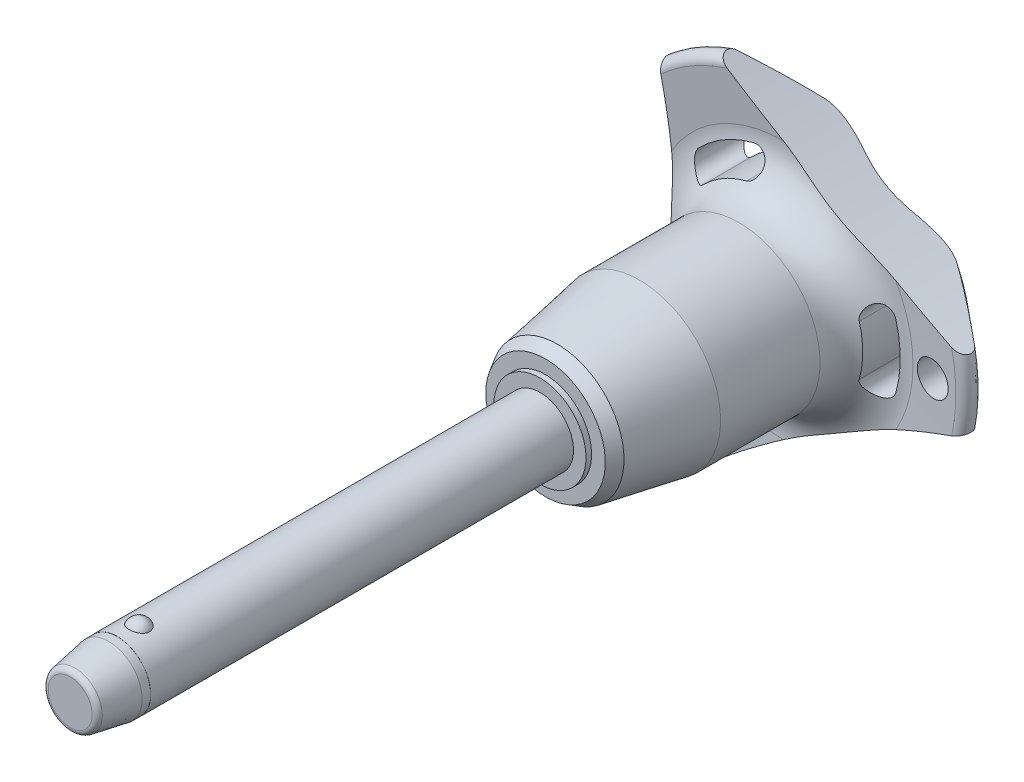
from build123d import *

# Parameters (mm, degrees)
SKETCH1_R           = 3
BOSS_EXTRUDE1_DEPTH = 35
SKETCH2_R           = 2.5
BOSS_EXTRUDE2_DEPTH = 26.7
BOSS_EXTRUDE3_START = 7
SKETCH1_2_R         = 3
BOSS_EXTRUDE3_DEPTH = 7
CHAMFER1_SIZE       = 3.5
CHAMFER1_SIZE2      = 0.617144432
FILLET1_R           = 0.5
SKETCH6_R           = 79.96
CUT_EXTRUDE1_DEPTH  = 67.015920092
CIRPATTERN1_COUNT   = 3
SKETCH7_R           = 1.5
CUT_EXTRUDE2_DEPTH  = 66.784951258
SKETCH8_R           = 3
SKETCH8_R_2         = 2.99
CUT_EXTRUDE3_DEPTH  = 4.2


with BuildPart() as part:
    # Sketch1 → Boss-Extrude1 (new body)
    with BuildSketch(Plane.XY):
        Circle(SKETCH1_R)
    extrude(amount=-BOSS_EXTRUDE1_DEPTH)

    # Sketch2 → Boss-Extrude2 (add)
    with BuildSketch(Plane(origin=(0, 0, -35), x_dir=(-1, 0, 0), z_dir=(0, 0, -1))):
        Circle(SKETCH2_R)
    extrude(amount=BOSS_EXTRUDE2_DEPTH)

    # Sketch3 → Revolve1 (revolve)
    with BuildSketch(Plane(origin=(0, 0, 0), x_dir=(0, 0, -1), z_dir=(1, 0, 0))):
        with BuildLine():
            Line((-0.866025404, 3.5), (-0.866025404, 1.5))
            ThreePointArc((-0.866025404, 1.5), (0.133974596, 2.5), (-0.866025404, 3.5))
        make_face()
        with BuildLine():
            Line((-0.866025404, -1.5), (-0.866025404, -3.5))
            ThreePointArc((-0.866025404, -3.5), (0.133974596, -2.5), (-0.866025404, -1.5))
        make_face()
    revolve(axis=Axis((0, -1.5, 0.866025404), (0, 1, 0)))

    # Sketch1_2 → Boss-Extrude3 (add)
    with BuildSketch(Plane.XY.offset(BOSS_EXTRUDE3_START)):
        Circle(SKETCH1_2_R)
    extrude(amount=-BOSS_EXTRUDE3_DEPTH)

    # Chamfer1
    chamfer1_edges = [part.edges().sort_by_distance(p)[0] for p in [
        (-3, 0, 7),
    ]]
    chamfer1_side = [part.faces().sort_by_distance(p)[0] for p in [
        (-3, 0, -14),
    ]]
    chamfer(chamfer1_edges, length=CHAMFER1_SIZE, length2=CHAMFER1_SIZE2, reference=chamfer1_side[0])

    # Fillet1
    fillet1_edges = [part.edges().sort_by_distance(p)[0] for p in [
        (-2.382855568, 0, 7),
        (2.5, 0, -61.7),
    ]]
    fillet(fillet1_edges, radius=FILLET1_R)

    # Sketch4 → Revolve2 (revolve)
    with BuildSketch(Plane(origin=(0, 0, 0), x_dir=(0, 0, -1), z_dir=(1, 0, 0)), mode=Mode.PRIVATE) as revolve2_sk:
        Polygon((35, 0), (35, 4.118359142), (35.5, 4.118359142), (35.5, 5.343400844), (36.560917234, 5.955921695), (43.9, 7.25), (52.8, 7.25), (52.8, 0), align=None)
    revolve(revolve2_sk.sketch.rotate(Axis((0, 0, -52.8), (0, 0, 1)), 90), axis=Axis((0, 0, -52.8), (0, 0, 1)))

    # Sketch5 → Revolve3 (revolve)
    with BuildSketch(Plane(origin=(0, 0, 0), x_dir=(0, 0, -1), z_dir=(1, 0, 0)), mode=Mode.PRIVATE) as revolve3_sk:
        with BuildLine():
            Line((56.78715932, 11.570250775), (56.452568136, 15.735949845))
            ThreePointArc((56.452568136, 15.735949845), (56.946485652, 16.540188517), (57.862835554, 16.314230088))
            Line((57.862835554, 16.314230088), (61.326414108, 12.186497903))
            ThreePointArc((61.326414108, 12.186497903), (61.7, 11.109282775), (61.261488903, 10.056825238))
            ThreePointArc((61.261488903, 10.056825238), (58.289873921, 5.413681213), (57.25, 0))
            Line((57.25, 0), (52.8, 0))
            Line((52.8, 0), (52.8, 7.25))
            ThreePointArc((52.8, 7.25), (55.739473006, 8.537160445), (56.78715932, 11.570250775))
        make_face()
    revolve(revolve3_sk.sketch.rotate(Axis((0, 0, -57.25), (0, 0, 1)), 90), axis=Axis((0, 0, -57.25), (0, 0, 1)))

    # Sketch6 → Cut-Extrude1 (cut, through all)
    with BuildSketch(Plane.XY):
        with Locations((-89.76, 0)):
            Circle(SKETCH6_R)
        with BuildLine():
            ThreePointArc((10.099921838, -2.834717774), (10.490188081, 0), (10.099921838, 2.834717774))
            ThreePointArc((10.099921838, 2.834717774), (8.768180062, 3.582738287), (8.020159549, 2.250996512))
            ThreePointArc((8.020159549, 2.250996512), (8.330062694, 0), (8.020159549, -2.250996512))
            ThreePointArc((8.020159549, -2.250996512), (8.768180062, -3.582738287), (10.099921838, -2.834717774))
        make_face()
    cut_extrude1 = extrude(amount=-CUT_EXTRUDE1_DEPTH, mode=Mode.SUBTRACT)

    # CirPattern1: Cut-Extrude1 ×3 about axis
    cirpattern1_axis = Axis((0, 0, 0), (0, 0, 1))
    for i in range(1, CIRPATTERN1_COUNT):
        add(cut_extrude1.rotate(cirpattern1_axis, i * 360 / CIRPATTERN1_COUNT), mode=Mode.SUBTRACT)

    # Sketch7 → Cut-Extrude2 (cut, through all)
    with BuildSketch(Plane.XY):
        with Locations(Location((13.490188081, 0, 0), (0, 0, 225.221865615))):
            Circle(SKETCH7_R)
    extrude(amount=-CUT_EXTRUDE2_DEPTH, mode=Mode.SUBTRACT)

    # Sketch8 → Cut-Extrude3 (cut)
    with BuildSketch(Plane.XY.offset(7)):
        Circle(SKETCH8_R)
        Circle(SKETCH8_R_2, mode=Mode.SUBTRACT)
    extrude(amount=-CUT_EXTRUDE3_DEPTH, mode=Mode.SUBTRACT)


solid = part.part
